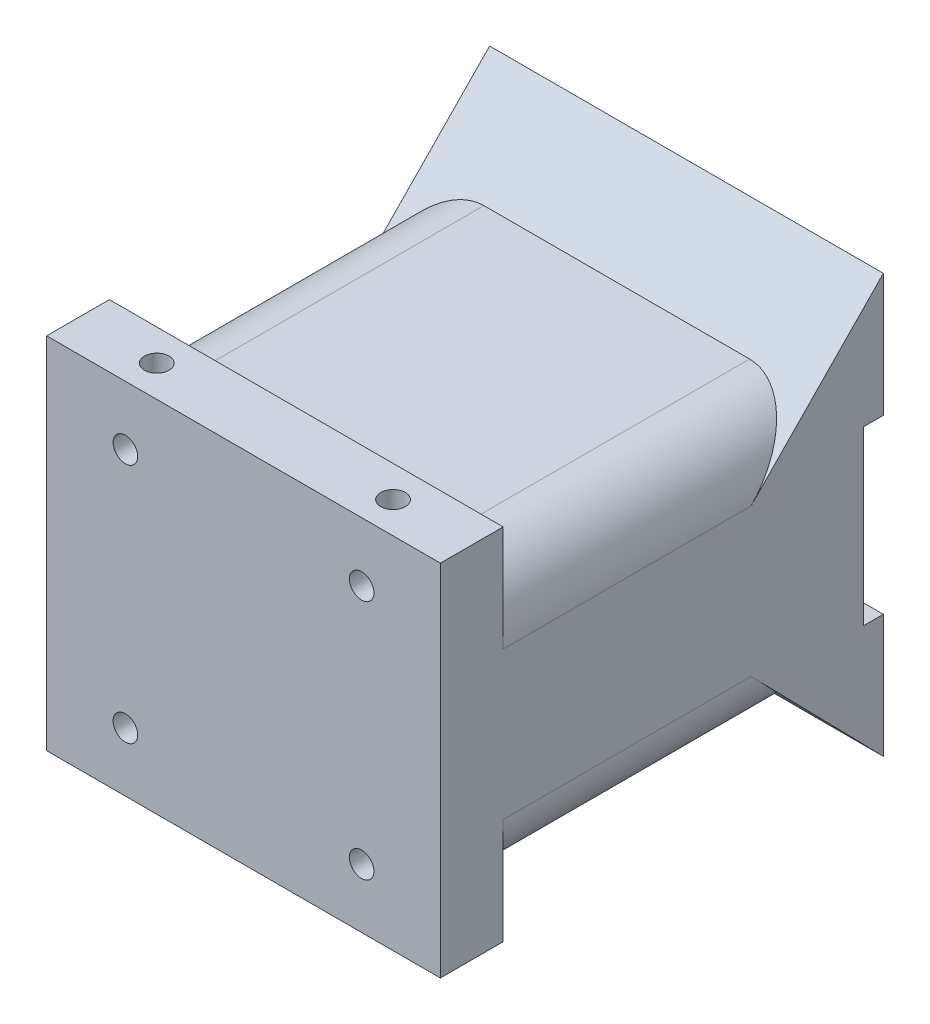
ISO-10303-21;
HEADER;
FILE_DESCRIPTION(('STEP AP214'),'2;1');
FILE_NAME('part.step','',(''),(''),'','','');
FILE_SCHEMA(('AUTOMOTIVE_DESIGN { 1 0 10303 214 1 1 1 1 }'));
ENDSEC;
DATA;
#1=APPLICATION_CONTEXT('core data for automotive mechanical design processes');
#2=APPLICATION_PROTOCOL_DEFINITION('international standard','automotive_design',2000,#1);
#3=PRODUCT_CONTEXT('',#1,'mechanical');
#4=PRODUCT('Part','Part','',(#3));
#5=PRODUCT_RELATED_PRODUCT_CATEGORY('part','',(#4));
#6=PRODUCT_DEFINITION_FORMATION('','',#4);
#7=PRODUCT_DEFINITION_CONTEXT('part definition',#1,'design');
#8=PRODUCT_DEFINITION('design','',#6,#7);
#9=PRODUCT_DEFINITION_SHAPE('','',#8);
#10=(LENGTH_UNIT() NAMED_UNIT(*) SI_UNIT(.MILLI.,.METRE.));
#11=(NAMED_UNIT(*) PLANE_ANGLE_UNIT() SI_UNIT($,.RADIAN.));
#12=(NAMED_UNIT(*) SI_UNIT($,.STERADIAN.) SOLID_ANGLE_UNIT());
#13=UNCERTAINTY_MEASURE_WITH_UNIT(LENGTH_MEASURE(1.E-05),#10,'distance_accuracy_value','');
#14=(GEOMETRIC_REPRESENTATION_CONTEXT(3) GLOBAL_UNCERTAINTY_ASSIGNED_CONTEXT((#13)) GLOBAL_UNIT_ASSIGNED_CONTEXT((#10,
#11,#12)) REPRESENTATION_CONTEXT('',''));
#15=CARTESIAN_POINT('',(0.,0.,0.));
#16=DIRECTION('',(0.,0.,1.));
#17=DIRECTION('',(1.,0.,0.));
#18=AXIS2_PLACEMENT_3D('',#15,#16,#17);
#19=CARTESIAN_POINT('',(80.,-36.5,90.));
#20=DIRECTION('',(0.,1.,0.));
#21=DIRECTION('',(0.,0.,1.));
#22=AXIS2_PLACEMENT_3D('',#19,#20,#21);
#23=PLANE('',#22);
#24=CARTESIAN_POINT('',(16.,-36.5,83.625));
#25=DIRECTION('',(0.,1.,0.));
#26=DIRECTION('',(0.,0.,1.));
#27=AXIS2_PLACEMENT_3D('',#24,#25,#26);
#28=CIRCLE('',#27,2.5);
#29=CARTESIAN_POINT('',(16.,-36.5,86.125));
#30=VERTEX_POINT('',#29);
#31=EDGE_CURVE('E357',#30,#30,#28,.T.);
#32=ORIENTED_EDGE('',*,*,#31,.T.);
#33=EDGE_LOOP('',(#32));
#34=FACE_BOUND('',#33,.T.);
#35=DIRECTION('',(0.,0.,-1.));
#36=VECTOR('',#35,1.);
#37=CARTESIAN_POINT('',(0.,-36.5,90.));
#38=LINE('',#37,#36);
#39=CARTESIAN_POINT('',(0.,-36.5,90.));
#40=VERTEX_POINT('',#39);
#41=CARTESIAN_POINT('',(0.,-36.5,77.25));
#42=VERTEX_POINT('',#41);
#43=EDGE_CURVE('E253',#40,#42,#38,.T.);
#44=ORIENTED_EDGE('',*,*,#43,.T.);
#45=DIRECTION('',(-1.,0.,0.));
#46=VECTOR('',#45,1.);
#47=CARTESIAN_POINT('',(80.,-36.5,77.25));
#48=LINE('',#47,#46);
#49=CARTESIAN_POINT('',(80.,-36.5,77.25));
#50=VERTEX_POINT('',#49);
#51=EDGE_CURVE('E266',#50,#42,#48,.T.);
#52=ORIENTED_EDGE('',*,*,#51,.F.);
#53=DIRECTION('',(0.,0.,-1.));
#54=VECTOR('',#53,1.);
#55=CARTESIAN_POINT('',(80.,-36.5,90.));
#56=LINE('',#55,#54);
#57=CARTESIAN_POINT('',(80.,-36.5,90.));
#58=VERTEX_POINT('',#57);
#59=EDGE_CURVE('E307',#58,#50,#56,.T.);
#60=ORIENTED_EDGE('',*,*,#59,.F.);
#61=DIRECTION('',(-1.,0.,0.));
#62=VECTOR('',#61,1.);
#63=CARTESIAN_POINT('',(80.,-36.5,90.));
#64=LINE('',#63,#62);
#65=EDGE_CURVE('E269',#58,#40,#64,.T.);
#66=ORIENTED_EDGE('',*,*,#65,.T.);
#67=EDGE_LOOP('',(#44,#52,#60,#66));
#68=FACE_BOUND('',#67,.T.);
#69=CARTESIAN_POINT('',(64.,-36.5,83.625));
#70=DIRECTION('',(0.,1.,0.));
#71=DIRECTION('',(0.,0.,1.));
#72=AXIS2_PLACEMENT_3D('',#69,#70,#71);
#73=CIRCLE('',#72,2.5);
#74=CARTESIAN_POINT('',(64.,-36.5,86.125));
#75=VERTEX_POINT('',#74);
#76=EDGE_CURVE('E363',#75,#75,#73,.T.);
#77=ORIENTED_EDGE('',*,*,#76,.T.);
#78=EDGE_LOOP('',(#77));
#79=FACE_BOUND('',#78,.T.);
#80=ADVANCED_FACE('F38',(#34,#68,#79),#23,.F.);
#81=CARTESIAN_POINT('',(80.,36.5,90.));
#82=DIRECTION('',(0.,0.,-1.));
#83=DIRECTION('',(-1.,0.,0.));
#84=AXIS2_PLACEMENT_3D('',#81,#82,#83);
#85=PLANE('',#84);
#86=CARTESIAN_POINT('',(16.,-24.5,90.));
#87=DIRECTION('',(0.,0.,-1.));
#88=DIRECTION('',(1.,0.,0.));
#89=AXIS2_PLACEMENT_3D('',#86,#87,#88);
#90=CIRCLE('',#89,2.5);
#91=CARTESIAN_POINT('',(18.5,-24.5,90.));
#92=VERTEX_POINT('',#91);
#93=EDGE_CURVE('E345',#92,#92,#90,.T.);
#94=ORIENTED_EDGE('',*,*,#93,.T.);
#95=EDGE_LOOP('',(#94));
#96=FACE_BOUND('',#95,.T.);
#97=CARTESIAN_POINT('',(64.,24.5,90.));
#98=DIRECTION('',(0.,0.,1.));
#99=DIRECTION('',(1.,0.,0.));
#100=AXIS2_PLACEMENT_3D('',#97,#98,#99);
#101=CIRCLE('',#100,2.49999999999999);
#102=CARTESIAN_POINT('',(66.5,24.5,90.));
#103=VERTEX_POINT('',#102);
#104=EDGE_CURVE('E327',#103,#103,#101,.T.);
#105=ORIENTED_EDGE('',*,*,#104,.F.);
#106=EDGE_LOOP('',(#105));
#107=FACE_BOUND('',#106,.T.);
#108=CARTESIAN_POINT('',(16.,24.5,90.));
#109=DIRECTION('',(0.,0.,1.));
#110=DIRECTION('',(1.,0.,0.));
#111=AXIS2_PLACEMENT_3D('',#108,#109,#110);
#112=CIRCLE('',#111,2.5);
#113=CARTESIAN_POINT('',(18.5,24.5,90.));
#114=VERTEX_POINT('',#113);
#115=EDGE_CURVE('E321',#114,#114,#112,.T.);
#116=ORIENTED_EDGE('',*,*,#115,.F.);
#117=EDGE_LOOP('',(#116));
#118=FACE_BOUND('',#117,.T.);
#119=DIRECTION('',(0.,-1.,0.));
#120=VECTOR('',#119,1.);
#121=CARTESIAN_POINT('',(0.,36.5,90.));
#122=LINE('',#121,#120);
#123=CARTESIAN_POINT('',(0.,36.5,90.));
#124=VERTEX_POINT('',#123);
#125=EDGE_CURVE('E246',#124,#40,#122,.T.);
#126=ORIENTED_EDGE('',*,*,#125,.T.);
#127=ORIENTED_EDGE('',*,*,#65,.F.);
#128=DIRECTION('',(0.,-1.,0.));
#129=VECTOR('',#128,1.);
#130=CARTESIAN_POINT('',(80.,36.5,90.));
#131=LINE('',#130,#129);
#132=CARTESIAN_POINT('',(80.,36.5,90.));
#133=VERTEX_POINT('',#132);
#134=EDGE_CURVE('E309',#133,#58,#131,.T.);
#135=ORIENTED_EDGE('',*,*,#134,.F.);
#136=DIRECTION('',(-1.,0.,0.));
#137=VECTOR('',#136,1.);
#138=CARTESIAN_POINT('',(80.,36.5,90.));
#139=LINE('',#138,#137);
#140=EDGE_CURVE('E272',#133,#124,#139,.T.);
#141=ORIENTED_EDGE('',*,*,#140,.T.);
#142=EDGE_LOOP('',(#126,#127,#135,#141));
#143=FACE_BOUND('',#142,.T.);
#144=CARTESIAN_POINT('',(64.,-24.5,90.));
#145=DIRECTION('',(0.,0.,-1.));
#146=DIRECTION('',(1.,0.,0.));
#147=AXIS2_PLACEMENT_3D('',#144,#145,#146);
#148=CIRCLE('',#147,2.49999999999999);
#149=CARTESIAN_POINT('',(66.5,-24.5,90.));
#150=VERTEX_POINT('',#149);
#151=EDGE_CURVE('E351',#150,#150,#148,.T.);
#152=ORIENTED_EDGE('',*,*,#151,.T.);
#153=EDGE_LOOP('',(#152));
#154=FACE_BOUND('',#153,.T.);
#155=ADVANCED_FACE('F381',(#96,#107,#118,#143,#154),#85,.F.);
#156=CARTESIAN_POINT('',(80.,-17.5,0.));
#157=DIRECTION('',(0.,0.,1.));
#158=DIRECTION('',(0.,-1.,0.));
#159=AXIS2_PLACEMENT_3D('',#156,#157,#158);
#160=PLANE('',#159);
#161=DIRECTION('',(0.,1.,0.));
#162=VECTOR('',#161,1.);
#163=CARTESIAN_POINT('',(0.,-17.5,0.));
#164=LINE('',#163,#162);
#165=CARTESIAN_POINT('',(0.,-42.5,0.));
#166=VERTEX_POINT('',#165);
#167=CARTESIAN_POINT('',(0.,-17.5,0.));
#168=VERTEX_POINT('',#167);
#169=EDGE_CURVE('E186',#166,#168,#164,.T.);
#170=ORIENTED_EDGE('',*,*,#169,.T.);
#171=DIRECTION('',(-1.,0.,0.));
#172=VECTOR('',#171,1.);
#173=CARTESIAN_POINT('',(80.,-17.5,0.));
#174=LINE('',#173,#172);
#175=CARTESIAN_POINT('',(80.,-17.5,0.));
#176=VERTEX_POINT('',#175);
#177=EDGE_CURVE('E166',#176,#168,#174,.T.);
#178=ORIENTED_EDGE('',*,*,#177,.F.);
#179=DIRECTION('',(0.,1.,0.));
#180=VECTOR('',#179,1.);
#181=CARTESIAN_POINT('',(80.,-17.5,0.));
#182=LINE('',#181,#180);
#183=CARTESIAN_POINT('',(80.,-42.5,0.));
#184=VERTEX_POINT('',#183);
#185=EDGE_CURVE('E173',#184,#176,#182,.T.);
#186=ORIENTED_EDGE('',*,*,#185,.F.);
#187=DIRECTION('',(-1.,0.,0.));
#188=VECTOR('',#187,1.);
#189=CARTESIAN_POINT('',(80.,-42.5,0.));
#190=LINE('',#189,#188);
#191=EDGE_CURVE('E258',#184,#166,#190,.T.);
#192=ORIENTED_EDGE('',*,*,#191,.T.);
#193=EDGE_LOOP('',(#170,#178,#186,#192));
#194=FACE_BOUND('',#193,.T.);
#195=ADVANCED_FACE('F184',(#194),#160,.F.);
#196=CARTESIAN_POINT('',(80.,-17.5,4.));
#197=DIRECTION('',(0.,-1.,0.));
#198=DIRECTION('',(0.,0.,-1.));
#199=AXIS2_PLACEMENT_3D('',#196,#197,#198);
#200=PLANE('',#199);
#201=DIRECTION('',(0.,0.,1.));
#202=VECTOR('',#201,1.);
#203=CARTESIAN_POINT('',(0.,-17.5,4.));
#204=LINE('',#203,#202);
#205=CARTESIAN_POINT('',(0.,-17.5,4.));
#206=VERTEX_POINT('',#205);
#207=EDGE_CURVE('E298',#168,#206,#204,.T.);
#208=ORIENTED_EDGE('',*,*,#207,.T.);
#209=DIRECTION('',(-1.,0.,0.));
#210=VECTOR('',#209,1.);
#211=CARTESIAN_POINT('',(80.,-17.5,4.));
#212=LINE('',#211,#210);
#213=CARTESIAN_POINT('',(80.,-17.5,4.));
#214=VERTEX_POINT('',#213);
#215=EDGE_CURVE('E169',#214,#206,#212,.T.);
#216=ORIENTED_EDGE('',*,*,#215,.F.);
#217=DIRECTION('',(0.,0.,1.));
#218=VECTOR('',#217,1.);
#219=CARTESIAN_POINT('',(80.,-17.5,4.));
#220=LINE('',#219,#218);
#221=EDGE_CURVE('E162',#176,#214,#220,.T.);
#222=ORIENTED_EDGE('',*,*,#221,.F.);
#223=ORIENTED_EDGE('',*,*,#177,.T.);
#224=EDGE_LOOP('',(#208,#216,#222,#223));
#225=FACE_BOUND('',#224,.T.);
#226=ADVANCED_FACE('F164',(#225),#200,.F.);
#227=CARTESIAN_POINT('',(80.,17.5,4.));
#228=DIRECTION('',(0.,0.,1.));
#229=DIRECTION('',(1.,0.,0.));
#230=AXIS2_PLACEMENT_3D('',#227,#228,#229);
#231=PLANE('',#230);
#232=DIRECTION('',(0.,1.,0.));
#233=VECTOR('',#232,1.);
#234=CARTESIAN_POINT('',(0.,17.5,4.));
#235=LINE('',#234,#233);
#236=CARTESIAN_POINT('',(0.,17.5,4.));
#237=VERTEX_POINT('',#236);
#238=EDGE_CURVE('E296',#206,#237,#235,.T.);
#239=ORIENTED_EDGE('',*,*,#238,.T.);
#240=DIRECTION('',(-1.,0.,0.));
#241=VECTOR('',#240,1.);
#242=CARTESIAN_POINT('',(80.,17.5,4.));
#243=LINE('',#242,#241);
#244=CARTESIAN_POINT('',(80.,17.5,4.));
#245=VERTEX_POINT('',#244);
#246=EDGE_CURVE('E191',#245,#237,#243,.T.);
#247=ORIENTED_EDGE('',*,*,#246,.F.);
#248=DIRECTION('',(0.,1.,0.));
#249=VECTOR('',#248,1.);
#250=CARTESIAN_POINT('',(80.,17.5,4.));
#251=LINE('',#250,#249);
#252=EDGE_CURVE('E172',#214,#245,#251,.T.);
#253=ORIENTED_EDGE('',*,*,#252,.F.);
#254=ORIENTED_EDGE('',*,*,#215,.T.);
#255=EDGE_LOOP('',(#239,#247,#253,#254));
#256=FACE_BOUND('',#255,.T.);
#257=ADVANCED_FACE('F412',(#256),#231,.F.);
#258=CARTESIAN_POINT('',(80.,17.5,0.));
#259=DIRECTION('',(0.,1.,0.));
#260=DIRECTION('',(0.,0.,1.));
#261=AXIS2_PLACEMENT_3D('',#258,#259,#260);
#262=PLANE('',#261);
#263=DIRECTION('',(0.,0.,-1.));
#264=VECTOR('',#263,1.);
#265=CARTESIAN_POINT('',(0.,17.5,0.));
#266=LINE('',#265,#264);
#267=CARTESIAN_POINT('',(0.,17.5,0.));
#268=VERTEX_POINT('',#267);
#269=EDGE_CURVE('E292',#237,#268,#266,.T.);
#270=ORIENTED_EDGE('',*,*,#269,.T.);
#271=DIRECTION('',(-1.,0.,0.));
#272=VECTOR('',#271,1.);
#273=CARTESIAN_POINT('',(80.,17.5,0.));
#274=LINE('',#273,#272);
#275=CARTESIAN_POINT('',(80.,17.5,0.));
#276=VERTEX_POINT('',#275);
#277=EDGE_CURVE('E283',#276,#268,#274,.T.);
#278=ORIENTED_EDGE('',*,*,#277,.F.);
#279=DIRECTION('',(0.,0.,-1.));
#280=VECTOR('',#279,1.);
#281=CARTESIAN_POINT('',(80.,17.5,0.));
#282=LINE('',#281,#280);
#283=EDGE_CURVE('E293',#245,#276,#282,.T.);
#284=ORIENTED_EDGE('',*,*,#283,.F.);
#285=ORIENTED_EDGE('',*,*,#246,.T.);
#286=EDGE_LOOP('',(#270,#278,#284,#285));
#287=FACE_BOUND('',#286,.T.);
#288=ADVANCED_FACE('F290',(#287),#262,.F.);
#289=CARTESIAN_POINT('',(80.,42.5,0.));
#290=DIRECTION('',(0.,0.,1.));
#291=DIRECTION('',(0.,-1.,0.));
#292=AXIS2_PLACEMENT_3D('',#289,#290,#291);
#293=PLANE('',#292);
#294=DIRECTION('',(0.,1.,0.));
#295=VECTOR('',#294,1.);
#296=CARTESIAN_POINT('',(0.,42.5,0.));
#297=LINE('',#296,#295);
#298=CARTESIAN_POINT('',(0.,42.5,0.));
#299=VERTEX_POINT('',#298);
#300=EDGE_CURVE('E248',#268,#299,#297,.T.);
#301=ORIENTED_EDGE('',*,*,#300,.T.);
#302=DIRECTION('',(-1.,0.,0.));
#303=VECTOR('',#302,1.);
#304=CARTESIAN_POINT('',(80.,42.5,0.));
#305=LINE('',#304,#303);
#306=CARTESIAN_POINT('',(80.,42.5,0.));
#307=VERTEX_POINT('',#306);
#308=EDGE_CURVE('E280',#307,#299,#305,.T.);
#309=ORIENTED_EDGE('',*,*,#308,.F.);
#310=DIRECTION('',(0.,1.,0.));
#311=VECTOR('',#310,1.);
#312=CARTESIAN_POINT('',(80.,42.5,0.));
#313=LINE('',#312,#311);
#314=EDGE_CURVE('E317',#276,#307,#313,.T.);
#315=ORIENTED_EDGE('',*,*,#314,.F.);
#316=ORIENTED_EDGE('',*,*,#277,.T.);
#317=EDGE_LOOP('',(#301,#309,#315,#316));
#318=FACE_BOUND('',#317,.T.);
#319=ADVANCED_FACE('F406',(#318),#293,.F.);
#320=CARTESIAN_POINT('',(80.,28.,14.1666666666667));
#321=DIRECTION('',(0.,-0.698837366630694,-0.715280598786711));
#322=DIRECTION('',(0.,0.715280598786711,-0.698837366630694));
#323=AXIS2_PLACEMENT_3D('',#320,#321,#322);
#324=PLANE('',#323);
#325=DIRECTION('',(0.,-0.715280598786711,0.698837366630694));
#326=VECTOR('',#325,1.);
#327=CARTESIAN_POINT('',(0.,28.,14.1666666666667));
#328=LINE('',#327,#326);
#329=CARTESIAN_POINT('',(0.,15.,26.867816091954));
#330=VERTEX_POINT('',#329);
#331=EDGE_CURVE('E241',#299,#330,#328,.T.);
#332=ORIENTED_EDGE('',*,*,#331,.T.);
#333=CARTESIAN_POINT('',(13.,15.,26.867816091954));
#334=DIRECTION('',(0.,-0.698837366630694,-0.715280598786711));
#335=DIRECTION('',(0.,-0.715280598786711,0.698837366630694));
#336=AXIS2_PLACEMENT_3D('',#333,#334,#335);
#337=ELLIPSE('',#336,18.174685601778,13.);
#338=CARTESIAN_POINT('',(13.,28.,14.1666666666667));
#339=VERTEX_POINT('',#338);
#340=EDGE_CURVE('E11',#330,#339,#337,.T.);
#341=ORIENTED_EDGE('',*,*,#340,.T.);
#342=DIRECTION('',(-1.,0.,0.));
#343=VECTOR('',#342,1.);
#344=CARTESIAN_POINT('',(80.,28.,14.1666666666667));
#345=LINE('',#344,#343);
#346=CARTESIAN_POINT('',(67.,28.,14.1666666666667));
#347=VERTEX_POINT('',#346);
#348=EDGE_CURVE('E278',#347,#339,#345,.T.);
#349=ORIENTED_EDGE('',*,*,#348,.F.);
#350=CARTESIAN_POINT('',(67.,15.,26.867816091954));
#351=DIRECTION('',(0.,-0.698837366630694,-0.715280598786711));
#352=DIRECTION('',(0.,0.715280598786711,-0.698837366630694));
#353=AXIS2_PLACEMENT_3D('',#350,#351,#352);
#354=ELLIPSE('',#353,18.174685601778,13.);
#355=CARTESIAN_POINT('',(80.,15.,26.867816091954));
#356=VERTEX_POINT('',#355);
#357=EDGE_CURVE('E224',#347,#356,#354,.T.);
#358=ORIENTED_EDGE('',*,*,#357,.T.);
#359=DIRECTION('',(0.,-0.715280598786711,0.698837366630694));
#360=VECTOR('',#359,1.);
#361=CARTESIAN_POINT('',(80.,28.,14.1666666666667));
#362=LINE('',#361,#360);
#363=EDGE_CURVE('E315',#307,#356,#362,.T.);
#364=ORIENTED_EDGE('',*,*,#363,.F.);
#365=ORIENTED_EDGE('',*,*,#308,.T.);
#366=EDGE_LOOP('',(#332,#341,#349,#358,#364,#365));
#367=FACE_BOUND('',#366,.T.);
#368=ADVANCED_FACE('F403',(#367),#324,.F.);
#369=CARTESIAN_POINT('',(80.,28.,14.1666666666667));
#370=DIRECTION('',(0.,-1.,0.));
#371=DIRECTION('',(0.,0.,-1.));
#372=AXIS2_PLACEMENT_3D('',#369,#370,#371);
#373=PLANE('',#372);
#374=DIRECTION('',(-1.,0.,0.));
#375=VECTOR('',#374,1.);
#376=CARTESIAN_POINT('',(80.,28.,77.25));
#377=LINE('',#376,#375);
#378=CARTESIAN_POINT('',(67.,28.,77.25));
#379=VERTEX_POINT('',#378);
#380=CARTESIAN_POINT('',(13.,28.,77.25));
#381=VERTEX_POINT('',#380);
#382=EDGE_CURVE('E234',#379,#381,#377,.T.);
#383=ORIENTED_EDGE('',*,*,#382,.F.);
#384=DIRECTION('',(0.,0.,1.));
#385=VECTOR('',#384,1.);
#386=CARTESIAN_POINT('',(67.,28.,14.1666666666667));
#387=LINE('',#386,#385);
#388=EDGE_CURVE('E58',#379,#347,#387,.F.);
#389=ORIENTED_EDGE('',*,*,#388,.T.);
#390=ORIENTED_EDGE('',*,*,#348,.T.);
#391=DIRECTION('',(0.,0.,1.));
#392=VECTOR('',#391,1.);
#393=CARTESIAN_POINT('',(13.,28.,14.1666666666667));
#394=LINE('',#393,#392);
#395=EDGE_CURVE('E208',#339,#381,#394,.T.);
#396=ORIENTED_EDGE('',*,*,#395,.T.);
#397=EDGE_LOOP('',(#383,#389,#390,#396));
#398=FACE_BOUND('',#397,.T.);
#399=ADVANCED_FACE('F400',(#398),#373,.F.);
#400=CARTESIAN_POINT('',(80.,28.,77.25));
#401=DIRECTION('',(0.,0.,1.));
#402=DIRECTION('',(1.,0.,0.));
#403=AXIS2_PLACEMENT_3D('',#400,#401,#402);
#404=PLANE('',#403);
#405=DIRECTION('',(0.,1.,0.));
#406=VECTOR('',#405,1.);
#407=CARTESIAN_POINT('',(0.,28.,77.25));
#408=LINE('',#407,#406);
#409=CARTESIAN_POINT('',(0.,15.,77.25));
#410=VERTEX_POINT('',#409);
#411=CARTESIAN_POINT('',(0.,36.5,77.25));
#412=VERTEX_POINT('',#411);
#413=EDGE_CURVE('E232',#410,#412,#408,.T.);
#414=ORIENTED_EDGE('',*,*,#413,.T.);
#415=DIRECTION('',(-1.,0.,0.));
#416=VECTOR('',#415,1.);
#417=CARTESIAN_POINT('',(80.,36.5,77.25));
#418=LINE('',#417,#416);
#419=CARTESIAN_POINT('',(80.,36.5,77.25));
#420=VERTEX_POINT('',#419);
#421=EDGE_CURVE('E275',#420,#412,#418,.T.);
#422=ORIENTED_EDGE('',*,*,#421,.F.);
#423=DIRECTION('',(0.,1.,0.));
#424=VECTOR('',#423,1.);
#425=CARTESIAN_POINT('',(80.,28.,77.25));
#426=LINE('',#425,#424);
#427=CARTESIAN_POINT('',(80.,15.,77.25));
#428=VERTEX_POINT('',#427);
#429=EDGE_CURVE('E313',#428,#420,#426,.T.);
#430=ORIENTED_EDGE('',*,*,#429,.F.);
#431=CARTESIAN_POINT('',(67.,15.,77.25));
#432=DIRECTION('',(0.,0.,1.));
#433=DIRECTION('',(1.,0.,0.));
#434=AXIS2_PLACEMENT_3D('',#431,#432,#433);
#435=CIRCLE('',#434,13.);
#436=EDGE_CURVE('E222',#428,#379,#435,.T.);
#437=ORIENTED_EDGE('',*,*,#436,.T.);
#438=ORIENTED_EDGE('',*,*,#382,.T.);
#439=CARTESIAN_POINT('',(13.,15.,77.25));
#440=DIRECTION('',(0.,0.,1.));
#441=DIRECTION('',(1.,0.,0.));
#442=AXIS2_PLACEMENT_3D('',#439,#440,#441);
#443=CIRCLE('',#442,13.);
#444=EDGE_CURVE('E46',#381,#410,#443,.T.);
#445=ORIENTED_EDGE('',*,*,#444,.T.);
#446=EDGE_LOOP('',(#414,#422,#430,#437,#438,#445));
#447=FACE_BOUND('',#446,.T.);
#448=ADVANCED_FACE('F230',(#447),#404,.F.);
#449=CARTESIAN_POINT('',(80.,36.5,77.25));
#450=DIRECTION('',(0.,-1.,0.));
#451=DIRECTION('',(0.,0.,-1.));
#452=AXIS2_PLACEMENT_3D('',#449,#450,#451);
#453=PLANE('',#452);
#454=CARTESIAN_POINT('',(64.,36.5,83.625));
#455=DIRECTION('',(0.,1.,0.));
#456=DIRECTION('',(0.,0.,1.));
#457=AXIS2_PLACEMENT_3D('',#454,#455,#456);
#458=CIRCLE('',#457,2.5);
#459=CARTESIAN_POINT('',(64.,36.5,86.125));
#460=VERTEX_POINT('',#459);
#461=EDGE_CURVE('E339',#460,#460,#458,.T.);
#462=ORIENTED_EDGE('',*,*,#461,.F.);
#463=EDGE_LOOP('',(#462));
#464=FACE_BOUND('',#463,.T.);
#465=CARTESIAN_POINT('',(16.,36.5,83.625));
#466=DIRECTION('',(0.,1.,0.));
#467=DIRECTION('',(0.,0.,1.));
#468=AXIS2_PLACEMENT_3D('',#465,#466,#467);
#469=CIRCLE('',#468,2.5);
#470=CARTESIAN_POINT('',(16.,36.5,86.125));
#471=VERTEX_POINT('',#470);
#472=EDGE_CURVE('E333',#471,#471,#469,.T.);
#473=ORIENTED_EDGE('',*,*,#472,.F.);
#474=EDGE_LOOP('',(#473));
#475=FACE_BOUND('',#474,.T.);
#476=DIRECTION('',(0.,0.,1.));
#477=VECTOR('',#476,1.);
#478=CARTESIAN_POINT('',(0.,36.5,77.25));
#479=LINE('',#478,#477);
#480=EDGE_CURVE('E244',#412,#124,#479,.T.);
#481=ORIENTED_EDGE('',*,*,#480,.T.);
#482=ORIENTED_EDGE('',*,*,#140,.F.);
#483=DIRECTION('',(0.,0.,1.));
#484=VECTOR('',#483,1.);
#485=CARTESIAN_POINT('',(80.,36.5,77.25));
#486=LINE('',#485,#484);
#487=EDGE_CURVE('E311',#420,#133,#486,.T.);
#488=ORIENTED_EDGE('',*,*,#487,.F.);
#489=ORIENTED_EDGE('',*,*,#421,.T.);
#490=EDGE_LOOP('',(#481,#482,#488,#489));
#491=FACE_BOUND('',#490,.T.);
#492=ADVANCED_FACE('F394',(#464,#475,#491),#453,.F.);
#493=CARTESIAN_POINT('',(80.,-36.5,77.25));
#494=DIRECTION('',(0.,0.,1.));
#495=DIRECTION('',(1.,0.,0.));
#496=AXIS2_PLACEMENT_3D('',#493,#494,#495);
#497=PLANE('',#496);
#498=DIRECTION('',(0.,1.,0.));
#499=VECTOR('',#498,1.);
#500=CARTESIAN_POINT('',(0.,-36.5,77.25));
#501=LINE('',#500,#499);
#502=CARTESIAN_POINT('',(0.,-15.,77.25));
#503=VERTEX_POINT('',#502);
#504=EDGE_CURVE('E255',#42,#503,#501,.T.);
#505=ORIENTED_EDGE('',*,*,#504,.T.);
#506=CARTESIAN_POINT('',(13.,-15.,77.25));
#507=DIRECTION('',(0.,0.,1.));
#508=DIRECTION('',(1.,0.,0.));
#509=AXIS2_PLACEMENT_3D('',#506,#507,#508);
#510=CIRCLE('',#509,13.);
#511=CARTESIAN_POINT('',(13.,-28.,77.25));
#512=VERTEX_POINT('',#511);
#513=EDGE_CURVE('E215',#503,#512,#510,.T.);
#514=ORIENTED_EDGE('',*,*,#513,.T.);
#515=DIRECTION('',(-1.,0.,0.));
#516=VECTOR('',#515,1.);
#517=CARTESIAN_POINT('',(80.,-28.,77.25));
#518=LINE('',#517,#516);
#519=CARTESIAN_POINT('',(67.,-28.,77.25));
#520=VERTEX_POINT('',#519);
#521=EDGE_CURVE('E263',#520,#512,#518,.T.);
#522=ORIENTED_EDGE('',*,*,#521,.F.);
#523=CARTESIAN_POINT('',(67.,-15.,77.25));
#524=DIRECTION('',(0.,0.,1.));
#525=DIRECTION('',(1.,0.,0.));
#526=AXIS2_PLACEMENT_3D('',#523,#524,#525);
#527=CIRCLE('',#526,13.);
#528=CARTESIAN_POINT('',(80.,-15.,77.25));
#529=VERTEX_POINT('',#528);
#530=EDGE_CURVE('E219',#520,#529,#527,.T.);
#531=ORIENTED_EDGE('',*,*,#530,.T.);
#532=DIRECTION('',(0.,1.,0.));
#533=VECTOR('',#532,1.);
#534=CARTESIAN_POINT('',(80.,-36.5,77.25));
#535=LINE('',#534,#533);
#536=EDGE_CURVE('E305',#50,#529,#535,.T.);
#537=ORIENTED_EDGE('',*,*,#536,.F.);
#538=ORIENTED_EDGE('',*,*,#51,.T.);
#539=EDGE_LOOP('',(#505,#514,#522,#531,#537,#538));
#540=FACE_BOUND('',#539,.T.);
#541=ADVANCED_FACE('F391',(#540),#497,.F.);
#542=CARTESIAN_POINT('',(80.,-28.,77.25));
#543=DIRECTION('',(0.,1.,0.));
#544=DIRECTION('',(0.,0.,1.));
#545=AXIS2_PLACEMENT_3D('',#542,#543,#544);
#546=PLANE('',#545);
#547=ORIENTED_EDGE('',*,*,#521,.T.);
#548=DIRECTION('',(0.,0.,-1.));
#549=VECTOR('',#548,1.);
#550=CARTESIAN_POINT('',(13.,-28.,77.25));
#551=LINE('',#550,#549);
#552=CARTESIAN_POINT('',(13.,-28.,14.1666666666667));
#553=VERTEX_POINT('',#552);
#554=EDGE_CURVE('E189',#512,#553,#551,.T.);
#555=ORIENTED_EDGE('',*,*,#554,.T.);
#556=DIRECTION('',(-1.,0.,0.));
#557=VECTOR('',#556,1.);
#558=CARTESIAN_POINT('',(80.,-28.,14.1666666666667));
#559=LINE('',#558,#557);
#560=CARTESIAN_POINT('',(67.,-28.,14.1666666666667));
#561=VERTEX_POINT('',#560);
#562=EDGE_CURVE('E260',#561,#553,#559,.T.);
#563=ORIENTED_EDGE('',*,*,#562,.F.);
#564=DIRECTION('',(0.,0.,-1.));
#565=VECTOR('',#564,1.);
#566=CARTESIAN_POINT('',(67.,-28.,77.25));
#567=LINE('',#566,#565);
#568=EDGE_CURVE('E187',#561,#520,#567,.F.);
#569=ORIENTED_EDGE('',*,*,#568,.T.);
#570=EDGE_LOOP('',(#547,#555,#563,#569));
#571=FACE_BOUND('',#570,.T.);
#572=ADVANCED_FACE('F462',(#571),#546,.F.);
#573=CARTESIAN_POINT('',(80.,-28.,14.1666666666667));
#574=DIRECTION('',(0.,0.698837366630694,-0.715280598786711));
#575=DIRECTION('',(0.,0.715280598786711,0.698837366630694));
#576=AXIS2_PLACEMENT_3D('',#573,#574,#575);
#577=PLANE('',#576);
#578=DIRECTION('',(0.,-0.715280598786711,-0.698837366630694));
#579=VECTOR('',#578,1.);
#580=CARTESIAN_POINT('',(0.,-28.,14.1666666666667));
#581=LINE('',#580,#579);
#582=CARTESIAN_POINT('',(0.,-15.,26.867816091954));
#583=VERTEX_POINT('',#582);
#584=EDGE_CURVE('E182',#583,#166,#581,.T.);
#585=ORIENTED_EDGE('',*,*,#584,.T.);
#586=ORIENTED_EDGE('',*,*,#191,.F.);
#587=DIRECTION('',(0.,-0.715280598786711,-0.698837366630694));
#588=VECTOR('',#587,1.);
#589=CARTESIAN_POINT('',(80.,-28.,14.1666666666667));
#590=LINE('',#589,#588);
#591=CARTESIAN_POINT('',(80.,-15.,26.867816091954));
#592=VERTEX_POINT('',#591);
#593=EDGE_CURVE('E178',#592,#184,#590,.T.);
#594=ORIENTED_EDGE('',*,*,#593,.F.);
#595=CARTESIAN_POINT('',(67.,-15.,26.867816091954));
#596=DIRECTION('',(0.,0.698837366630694,-0.715280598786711));
#597=DIRECTION('',(0.,0.715280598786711,0.698837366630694));
#598=AXIS2_PLACEMENT_3D('',#595,#596,#597);
#599=ELLIPSE('',#598,18.174685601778,13.);
#600=EDGE_CURVE('E217',#592,#561,#599,.T.);
#601=ORIENTED_EDGE('',*,*,#600,.T.);
#602=ORIENTED_EDGE('',*,*,#562,.T.);
#603=CARTESIAN_POINT('',(13.,-15.,26.867816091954));
#604=DIRECTION('',(0.,0.698837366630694,-0.715280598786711));
#605=DIRECTION('',(0.,-0.715280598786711,-0.698837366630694));
#606=AXIS2_PLACEMENT_3D('',#603,#604,#605);
#607=ELLIPSE('',#606,18.174685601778,13.);
#608=EDGE_CURVE('E212',#553,#583,#607,.T.);
#609=ORIENTED_EDGE('',*,*,#608,.T.);
#610=EDGE_LOOP('',(#585,#586,#594,#601,#602,#609));
#611=FACE_BOUND('',#610,.T.);
#612=ADVANCED_FACE('F460',(#611),#577,.F.);
#613=CARTESIAN_POINT('',(80.,-28.,0.));
#614=DIRECTION('',(1.,0.,0.));
#615=DIRECTION('',(0.,0.,-1.));
#616=AXIS2_PLACEMENT_3D('',#613,#614,#615);
#617=PLANE('',#616);
#618=DIRECTION('',(0.,0.,-1.));
#619=VECTOR('',#618,1.);
#620=CARTESIAN_POINT('',(80.,-15.,14.1666666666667));
#621=LINE('',#620,#619);
#622=EDGE_CURVE('E206',#529,#592,#621,.T.);
#623=ORIENTED_EDGE('',*,*,#622,.T.);
#624=ORIENTED_EDGE('',*,*,#593,.T.);
#625=ORIENTED_EDGE('',*,*,#185,.T.);
#626=ORIENTED_EDGE('',*,*,#221,.T.);
#627=ORIENTED_EDGE('',*,*,#252,.T.);
#628=ORIENTED_EDGE('',*,*,#283,.T.);
#629=ORIENTED_EDGE('',*,*,#314,.T.);
#630=ORIENTED_EDGE('',*,*,#363,.T.);
#631=DIRECTION('',(0.,0.,1.));
#632=VECTOR('',#631,1.);
#633=CARTESIAN_POINT('',(80.,15.,77.25));
#634=LINE('',#633,#632);
#635=EDGE_CURVE('E203',#356,#428,#634,.T.);
#636=ORIENTED_EDGE('',*,*,#635,.T.);
#637=ORIENTED_EDGE('',*,*,#429,.T.);
#638=ORIENTED_EDGE('',*,*,#487,.T.);
#639=ORIENTED_EDGE('',*,*,#134,.T.);
#640=ORIENTED_EDGE('',*,*,#59,.T.);
#641=ORIENTED_EDGE('',*,*,#536,.T.);
#642=EDGE_LOOP('',(#623,#624,#625,#626,#627,#628,#629,#630,#636,#637,#638,#639,#640,#641));
#643=FACE_BOUND('',#642,.T.);
#644=ADVANCED_FACE('F177',(#643),#617,.T.);
#645=CARTESIAN_POINT('',(0.,-28.,0.));
#646=DIRECTION('',(1.,0.,0.));
#647=DIRECTION('',(0.,0.,-1.));
#648=AXIS2_PLACEMENT_3D('',#645,#646,#647);
#649=PLANE('',#648);
#650=ORIENTED_EDGE('',*,*,#584,.F.);
#651=DIRECTION('',(0.,0.,-1.));
#652=VECTOR('',#651,1.);
#653=CARTESIAN_POINT('',(0.,-15.,0.));
#654=LINE('',#653,#652);
#655=EDGE_CURVE('E200',#583,#503,#654,.F.);
#656=ORIENTED_EDGE('',*,*,#655,.T.);
#657=ORIENTED_EDGE('',*,*,#504,.F.);
#658=ORIENTED_EDGE('',*,*,#43,.F.);
#659=ORIENTED_EDGE('',*,*,#125,.F.);
#660=ORIENTED_EDGE('',*,*,#480,.F.);
#661=ORIENTED_EDGE('',*,*,#413,.F.);
#662=DIRECTION('',(0.,0.,1.));
#663=VECTOR('',#662,1.);
#664=CARTESIAN_POINT('',(0.,15.,0.));
#665=LINE('',#664,#663);
#666=EDGE_CURVE('E197',#410,#330,#665,.F.);
#667=ORIENTED_EDGE('',*,*,#666,.T.);
#668=ORIENTED_EDGE('',*,*,#331,.F.);
#669=ORIENTED_EDGE('',*,*,#300,.F.);
#670=ORIENTED_EDGE('',*,*,#269,.F.);
#671=ORIENTED_EDGE('',*,*,#238,.F.);
#672=ORIENTED_EDGE('',*,*,#207,.F.);
#673=ORIENTED_EDGE('',*,*,#169,.F.);
#674=EDGE_LOOP('',(#650,#656,#657,#658,#659,#660,#661,#667,#668,#669,#670,#671,#672,#673));
#675=FACE_BOUND('',#674,.T.);
#676=ADVANCED_FACE('F239',(#675),#649,.F.);
#677=CARTESIAN_POINT('',(13.,-15.,77.25));
#678=DIRECTION('',(0.,0.,-1.));
#679=DIRECTION('',(-1.,0.,0.));
#680=AXIS2_PLACEMENT_3D('',#677,#678,#679);
#681=CYLINDRICAL_SURFACE('',#680,13.);
#682=ORIENTED_EDGE('',*,*,#513,.F.);
#683=ORIENTED_EDGE('',*,*,#655,.F.);
#684=ORIENTED_EDGE('',*,*,#608,.F.);
#685=ORIENTED_EDGE('',*,*,#554,.F.);
#686=EDGE_LOOP('',(#682,#683,#684,#685));
#687=FACE_BOUND('',#686,.T.);
#688=ADVANCED_FACE('F419',(#687),#681,.T.);
#689=CARTESIAN_POINT('',(67.,-15.,0.));
#690=DIRECTION('',(0.,0.,1.));
#691=DIRECTION('',(1.,0.,0.));
#692=AXIS2_PLACEMENT_3D('',#689,#690,#691);
#693=CYLINDRICAL_SURFACE('',#692,13.);
#694=ORIENTED_EDGE('',*,*,#530,.F.);
#695=ORIENTED_EDGE('',*,*,#568,.F.);
#696=ORIENTED_EDGE('',*,*,#600,.F.);
#697=ORIENTED_EDGE('',*,*,#622,.F.);
#698=EDGE_LOOP('',(#694,#695,#696,#697));
#699=FACE_BOUND('',#698,.T.);
#700=ADVANCED_FACE('F422',(#699),#693,.T.);
#701=CARTESIAN_POINT('',(67.,15.,0.));
#702=DIRECTION('',(0.,0.,-1.));
#703=DIRECTION('',(-1.,0.,0.));
#704=AXIS2_PLACEMENT_3D('',#701,#702,#703);
#705=CYLINDRICAL_SURFACE('',#704,13.);
#706=ORIENTED_EDGE('',*,*,#357,.F.);
#707=ORIENTED_EDGE('',*,*,#388,.F.);
#708=ORIENTED_EDGE('',*,*,#436,.F.);
#709=ORIENTED_EDGE('',*,*,#635,.F.);
#710=EDGE_LOOP('',(#706,#707,#708,#709));
#711=FACE_BOUND('',#710,.T.);
#712=ADVANCED_FACE('F425',(#711),#705,.T.);
#713=CARTESIAN_POINT('',(13.,15.,14.1666666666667));
#714=DIRECTION('',(0.,0.,1.));
#715=DIRECTION('',(1.,0.,0.));
#716=AXIS2_PLACEMENT_3D('',#713,#714,#715);
#717=CYLINDRICAL_SURFACE('',#716,13.);
#718=ORIENTED_EDGE('',*,*,#340,.F.);
#719=ORIENTED_EDGE('',*,*,#666,.F.);
#720=ORIENTED_EDGE('',*,*,#444,.F.);
#721=ORIENTED_EDGE('',*,*,#395,.F.);
#722=EDGE_LOOP('',(#718,#719,#720,#721));
#723=FACE_BOUND('',#722,.T.);
#724=ADVANCED_FACE('F40',(#723),#717,.T.);
#725=CARTESIAN_POINT('',(16.,24.5,85.));
#726=DIRECTION('',(0.,0.,1.));
#727=DIRECTION('',(1.,0.,0.));
#728=AXIS2_PLACEMENT_3D('',#725,#726,#727);
#729=CYLINDRICAL_SURFACE('',#728,2.5);
#730=CARTESIAN_POINT('',(16.,24.5,85.));
#731=DIRECTION('',(0.,0.,1.));
#732=DIRECTION('',(1.,0.,0.));
#733=AXIS2_PLACEMENT_3D('',#730,#731,#732);
#734=CIRCLE('',#733,2.5);
#735=CARTESIAN_POINT('',(18.5,24.5,85.));
#736=VERTEX_POINT('',#735);
#737=EDGE_CURVE('E303',#736,#736,#734,.T.);
#738=ORIENTED_EDGE('',*,*,#737,.F.);
#739=EDGE_LOOP('',(#738));
#740=FACE_BOUND('',#739,.T.);
#741=ORIENTED_EDGE('',*,*,#115,.T.);
#742=EDGE_LOOP('',(#741));
#743=FACE_BOUND('',#742,.T.);
#744=ADVANCED_FACE('F432',(#740,#743),#729,.F.);
#745=CARTESIAN_POINT('',(16.,24.5,85.));
#746=DIRECTION('',(0.,0.,1.));
#747=DIRECTION('',(1.,0.,0.));
#748=AXIS2_PLACEMENT_3D('',#745,#746,#747);
#749=PLANE('',#748);
#750=ORIENTED_EDGE('',*,*,#737,.T.);
#751=EDGE_LOOP('',(#750));
#752=FACE_BOUND('',#751,.T.);
#753=ADVANCED_FACE('F479',(#752),#749,.T.);
#754=CARTESIAN_POINT('',(64.,24.5,85.));
#755=DIRECTION('',(0.,0.,1.));
#756=DIRECTION('',(1.,0.,0.));
#757=AXIS2_PLACEMENT_3D('',#754,#755,#756);
#758=CYLINDRICAL_SURFACE('',#757,2.49999999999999);
#759=CARTESIAN_POINT('',(64.,24.5,85.));
#760=DIRECTION('',(0.,0.,1.));
#761=DIRECTION('',(1.,0.,0.));
#762=AXIS2_PLACEMENT_3D('',#759,#760,#761);
#763=CIRCLE('',#762,2.49999999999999);
#764=CARTESIAN_POINT('',(66.5,24.5,85.));
#765=VERTEX_POINT('',#764);
#766=EDGE_CURVE('E324',#765,#765,#763,.T.);
#767=ORIENTED_EDGE('',*,*,#766,.F.);
#768=EDGE_LOOP('',(#767));
#769=FACE_BOUND('',#768,.T.);
#770=ORIENTED_EDGE('',*,*,#104,.T.);
#771=EDGE_LOOP('',(#770));
#772=FACE_BOUND('',#771,.T.);
#773=ADVANCED_FACE('F483',(#769,#772),#758,.F.);
#774=CARTESIAN_POINT('',(64.,24.5,85.));
#775=DIRECTION('',(0.,0.,1.));
#776=DIRECTION('',(1.,0.,0.));
#777=AXIS2_PLACEMENT_3D('',#774,#775,#776);
#778=PLANE('',#777);
#779=ORIENTED_EDGE('',*,*,#766,.T.);
#780=EDGE_LOOP('',(#779));
#781=FACE_BOUND('',#780,.T.);
#782=ADVANCED_FACE('F487',(#781),#778,.T.);
#783=CARTESIAN_POINT('',(16.,31.5,83.625));
#784=DIRECTION('',(0.,1.,0.));
#785=DIRECTION('',(0.,0.,1.));
#786=AXIS2_PLACEMENT_3D('',#783,#784,#785);
#787=CYLINDRICAL_SURFACE('',#786,2.5);
#788=CARTESIAN_POINT('',(16.,31.5,83.625));
#789=DIRECTION('',(0.,1.,0.));
#790=DIRECTION('',(0.,0.,1.));
#791=AXIS2_PLACEMENT_3D('',#788,#789,#790);
#792=CIRCLE('',#791,2.5);
#793=CARTESIAN_POINT('',(16.,31.5,86.125));
#794=VERTEX_POINT('',#793);
#795=EDGE_CURVE('E330',#794,#794,#792,.T.);
#796=ORIENTED_EDGE('',*,*,#795,.F.);
#797=EDGE_LOOP('',(#796));
#798=FACE_BOUND('',#797,.T.);
#799=ORIENTED_EDGE('',*,*,#472,.T.);
#800=EDGE_LOOP('',(#799));
#801=FACE_BOUND('',#800,.T.);
#802=ADVANCED_FACE('F491',(#798,#801),#787,.F.);
#803=CARTESIAN_POINT('',(16.,31.5,83.625));
#804=DIRECTION('',(0.,1.,0.));
#805=DIRECTION('',(0.,0.,1.));
#806=AXIS2_PLACEMENT_3D('',#803,#804,#805);
#807=PLANE('',#806);
#808=ORIENTED_EDGE('',*,*,#795,.T.);
#809=EDGE_LOOP('',(#808));
#810=FACE_BOUND('',#809,.T.);
#811=ADVANCED_FACE('F495',(#810),#807,.T.);
#812=CARTESIAN_POINT('',(64.,31.5,83.625));
#813=DIRECTION('',(0.,1.,0.));
#814=DIRECTION('',(0.,0.,1.));
#815=AXIS2_PLACEMENT_3D('',#812,#813,#814);
#816=CYLINDRICAL_SURFACE('',#815,2.5);
#817=CARTESIAN_POINT('',(64.,31.5,83.625));
#818=DIRECTION('',(0.,1.,0.));
#819=DIRECTION('',(0.,0.,1.));
#820=AXIS2_PLACEMENT_3D('',#817,#818,#819);
#821=CIRCLE('',#820,2.5);
#822=CARTESIAN_POINT('',(64.,31.5,86.125));
#823=VERTEX_POINT('',#822);
#824=EDGE_CURVE('E336',#823,#823,#821,.T.);
#825=ORIENTED_EDGE('',*,*,#824,.F.);
#826=EDGE_LOOP('',(#825));
#827=FACE_BOUND('',#826,.T.);
#828=ORIENTED_EDGE('',*,*,#461,.T.);
#829=EDGE_LOOP('',(#828));
#830=FACE_BOUND('',#829,.T.);
#831=ADVANCED_FACE('F499',(#827,#830),#816,.F.);
#832=CARTESIAN_POINT('',(64.,31.5,83.625));
#833=DIRECTION('',(0.,1.,0.));
#834=DIRECTION('',(0.,0.,1.));
#835=AXIS2_PLACEMENT_3D('',#832,#833,#834);
#836=PLANE('',#835);
#837=ORIENTED_EDGE('',*,*,#824,.T.);
#838=EDGE_LOOP('',(#837));
#839=FACE_BOUND('',#838,.T.);
#840=ADVANCED_FACE('F503',(#839),#836,.T.);
#841=CARTESIAN_POINT('',(16.,-24.5,85.));
#842=DIRECTION('',(0.,0.,1.));
#843=DIRECTION('',(1.,0.,0.));
#844=AXIS2_PLACEMENT_3D('',#841,#842,#843);
#845=CYLINDRICAL_SURFACE('',#844,2.5);
#846=CARTESIAN_POINT('',(16.,-24.5,85.));
#847=DIRECTION('',(0.,0.,-1.));
#848=DIRECTION('',(1.,0.,0.));
#849=AXIS2_PLACEMENT_3D('',#846,#847,#848);
#850=CIRCLE('',#849,2.5);
#851=CARTESIAN_POINT('',(18.5,-24.5,85.));
#852=VERTEX_POINT('',#851);
#853=EDGE_CURVE('E342',#852,#852,#850,.T.);
#854=ORIENTED_EDGE('',*,*,#853,.T.);
#855=EDGE_LOOP('',(#854));
#856=FACE_BOUND('',#855,.T.);
#857=ORIENTED_EDGE('',*,*,#93,.F.);
#858=EDGE_LOOP('',(#857));
#859=FACE_BOUND('',#858,.T.);
#860=ADVANCED_FACE('F507',(#856,#859),#845,.F.);
#861=CARTESIAN_POINT('',(16.,-24.5,85.));
#862=DIRECTION('',(0.,0.,1.));
#863=DIRECTION('',(1.,0.,0.));
#864=AXIS2_PLACEMENT_3D('',#861,#862,#863);
#865=PLANE('',#864);
#866=ORIENTED_EDGE('',*,*,#853,.F.);
#867=EDGE_LOOP('',(#866));
#868=FACE_BOUND('',#867,.T.);
#869=ADVANCED_FACE('F511',(#868),#865,.T.);
#870=CARTESIAN_POINT('',(64.,-24.5,85.));
#871=DIRECTION('',(0.,0.,1.));
#872=DIRECTION('',(1.,0.,0.));
#873=AXIS2_PLACEMENT_3D('',#870,#871,#872);
#874=CYLINDRICAL_SURFACE('',#873,2.49999999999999);
#875=CARTESIAN_POINT('',(64.,-24.5,85.));
#876=DIRECTION('',(0.,0.,-1.));
#877=DIRECTION('',(1.,0.,0.));
#878=AXIS2_PLACEMENT_3D('',#875,#876,#877);
#879=CIRCLE('',#878,2.49999999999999);
#880=CARTESIAN_POINT('',(66.5,-24.5,85.));
#881=VERTEX_POINT('',#880);
#882=EDGE_CURVE('E348',#881,#881,#879,.T.);
#883=ORIENTED_EDGE('',*,*,#882,.T.);
#884=EDGE_LOOP('',(#883));
#885=FACE_BOUND('',#884,.T.);
#886=ORIENTED_EDGE('',*,*,#151,.F.);
#887=EDGE_LOOP('',(#886));
#888=FACE_BOUND('',#887,.T.);
#889=ADVANCED_FACE('F515',(#885,#888),#874,.F.);
#890=CARTESIAN_POINT('',(64.,-24.5,85.));
#891=DIRECTION('',(0.,0.,1.));
#892=DIRECTION('',(1.,0.,0.));
#893=AXIS2_PLACEMENT_3D('',#890,#891,#892);
#894=PLANE('',#893);
#895=ORIENTED_EDGE('',*,*,#882,.F.);
#896=EDGE_LOOP('',(#895));
#897=FACE_BOUND('',#896,.T.);
#898=ADVANCED_FACE('F519',(#897),#894,.T.);
#899=CARTESIAN_POINT('',(16.,-31.5,83.625));
#900=DIRECTION('',(0.,-1.,0.));
#901=DIRECTION('',(0.,0.,-1.));
#902=AXIS2_PLACEMENT_3D('',#899,#900,#901);
#903=CYLINDRICAL_SURFACE('',#902,2.5);
#904=CARTESIAN_POINT('',(16.,-31.5,83.625));
#905=DIRECTION('',(0.,1.,0.));
#906=DIRECTION('',(0.,0.,1.));
#907=AXIS2_PLACEMENT_3D('',#904,#905,#906);
#908=CIRCLE('',#907,2.5);
#909=CARTESIAN_POINT('',(16.,-31.5,86.125));
#910=VERTEX_POINT('',#909);
#911=EDGE_CURVE('E354',#910,#910,#908,.T.);
#912=ORIENTED_EDGE('',*,*,#911,.T.);
#913=EDGE_LOOP('',(#912));
#914=FACE_BOUND('',#913,.T.);
#915=ORIENTED_EDGE('',*,*,#31,.F.);
#916=EDGE_LOOP('',(#915));
#917=FACE_BOUND('',#916,.T.);
#918=ADVANCED_FACE('F523',(#914,#917),#903,.F.);
#919=CARTESIAN_POINT('',(16.,-31.5,83.625));
#920=DIRECTION('',(0.,-1.,0.));
#921=DIRECTION('',(0.,0.,1.));
#922=AXIS2_PLACEMENT_3D('',#919,#920,#921);
#923=PLANE('',#922);
#924=ORIENTED_EDGE('',*,*,#911,.F.);
#925=EDGE_LOOP('',(#924));
#926=FACE_BOUND('',#925,.T.);
#927=ADVANCED_FACE('F378',(#926),#923,.T.);
#928=CARTESIAN_POINT('',(64.,-31.5,83.625));
#929=DIRECTION('',(0.,-1.,0.));
#930=DIRECTION('',(0.,0.,-1.));
#931=AXIS2_PLACEMENT_3D('',#928,#929,#930);
#932=CYLINDRICAL_SURFACE('',#931,2.5);
#933=CARTESIAN_POINT('',(64.,-31.5,83.625));
#934=DIRECTION('',(0.,1.,0.));
#935=DIRECTION('',(0.,0.,1.));
#936=AXIS2_PLACEMENT_3D('',#933,#934,#935);
#937=CIRCLE('',#936,2.5);
#938=CARTESIAN_POINT('',(64.,-31.5,86.125));
#939=VERTEX_POINT('',#938);
#940=EDGE_CURVE('E360',#939,#939,#937,.T.);
#941=ORIENTED_EDGE('',*,*,#940,.T.);
#942=EDGE_LOOP('',(#941));
#943=FACE_BOUND('',#942,.T.);
#944=ORIENTED_EDGE('',*,*,#76,.F.);
#945=EDGE_LOOP('',(#944));
#946=FACE_BOUND('',#945,.T.);
#947=ADVANCED_FACE('F369',(#943,#946),#932,.F.);
#948=CARTESIAN_POINT('',(64.,-31.5,83.625));
#949=DIRECTION('',(0.,-1.,0.));
#950=DIRECTION('',(0.,0.,1.));
#951=AXIS2_PLACEMENT_3D('',#948,#949,#950);
#952=PLANE('',#951);
#953=ORIENTED_EDGE('',*,*,#940,.F.);
#954=EDGE_LOOP('',(#953));
#955=FACE_BOUND('',#954,.T.);
#956=ADVANCED_FACE('F372',(#955),#952,.T.);
#957=CLOSED_SHELL('',(#80,#155,#195,#226,#257,#288,#319,#368,#399,#448,#492,#541,#572,#612,#644,
#676,#688,#700,#712,#724,#744,#753,#773,#782,#802,#811,#831,#840,#860,#869,#889,#898,#918,#927,
#947,#956));
#958=MANIFOLD_SOLID_BREP('B2',#957);
#959=ADVANCED_BREP_SHAPE_REPRESENTATION('',(#18,#958),#14);
#960=SHAPE_DEFINITION_REPRESENTATION(#9,#959);
ENDSEC;
END-ISO-10303-21;
